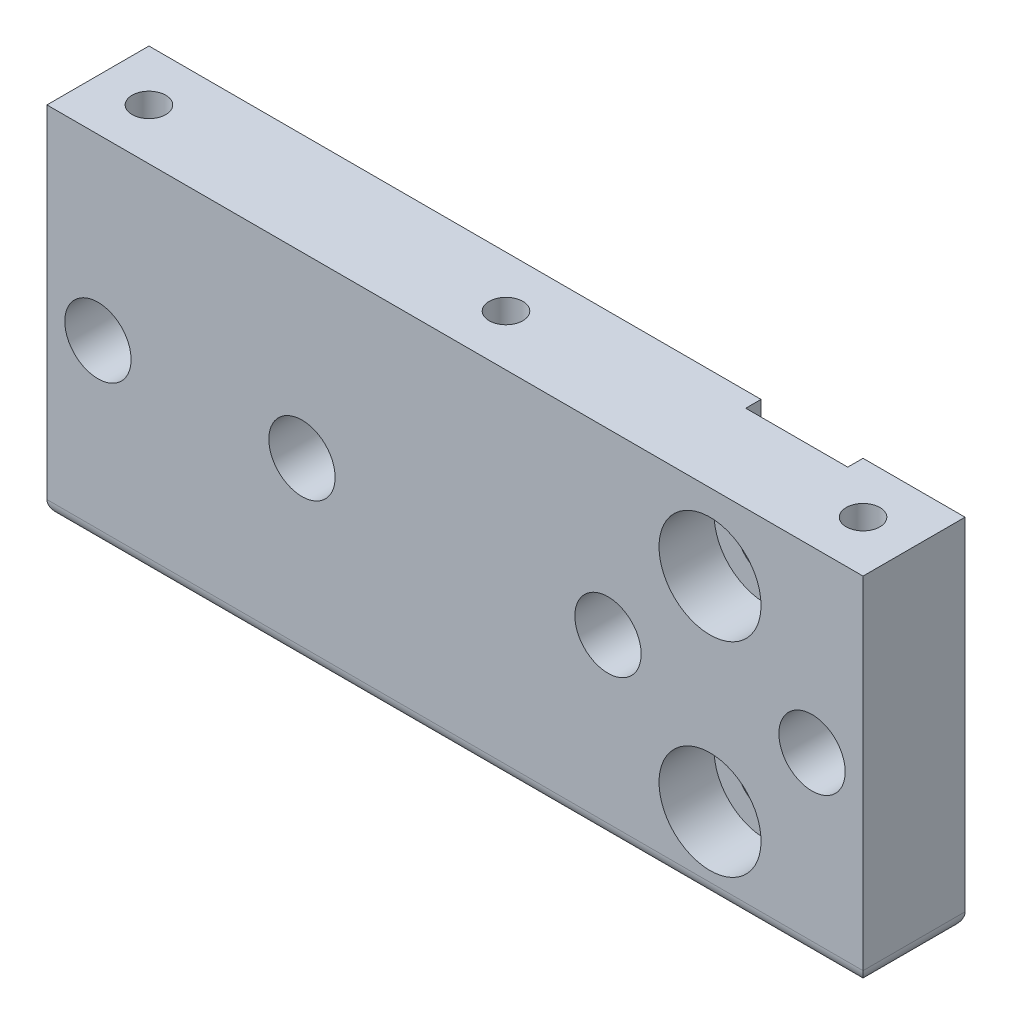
ISO-10303-21;
HEADER;
FILE_DESCRIPTION(('STEP AP214'),'2;1');
FILE_NAME('part.step','',(''),(''),'','','');
FILE_SCHEMA(('AUTOMOTIVE_DESIGN { 1 0 10303 214 1 1 1 1 }'));
ENDSEC;
DATA;
#1=APPLICATION_CONTEXT('core data for automotive mechanical design processes');
#2=APPLICATION_PROTOCOL_DEFINITION('international standard','automotive_design',2000,#1);
#3=PRODUCT_CONTEXT('',#1,'mechanical');
#4=PRODUCT('Part','Part','',(#3));
#5=PRODUCT_RELATED_PRODUCT_CATEGORY('part','',(#4));
#6=PRODUCT_DEFINITION_FORMATION('','',#4);
#7=PRODUCT_DEFINITION_CONTEXT('part definition',#1,'design');
#8=PRODUCT_DEFINITION('design','',#6,#7);
#9=PRODUCT_DEFINITION_SHAPE('','',#8);
#10=(LENGTH_UNIT() NAMED_UNIT(*) SI_UNIT(.MILLI.,.METRE.));
#11=(NAMED_UNIT(*) PLANE_ANGLE_UNIT() SI_UNIT($,.RADIAN.));
#12=(NAMED_UNIT(*) SI_UNIT($,.STERADIAN.) SOLID_ANGLE_UNIT());
#13=UNCERTAINTY_MEASURE_WITH_UNIT(LENGTH_MEASURE(1.E-05),#10,'distance_accuracy_value','');
#14=(GEOMETRIC_REPRESENTATION_CONTEXT(3) GLOBAL_UNCERTAINTY_ASSIGNED_CONTEXT((#13)) GLOBAL_UNIT_ASSIGNED_CONTEXT((#10,
#11,#12)) REPRESENTATION_CONTEXT('',''));
#15=CARTESIAN_POINT('',(0.,0.,0.));
#16=DIRECTION('',(0.,0.,1.));
#17=DIRECTION('',(1.,0.,0.));
#18=AXIS2_PLACEMENT_3D('',#15,#16,#17);
#19=CARTESIAN_POINT('',(35.,5.99999999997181,-5.));
#20=DIRECTION('',(0.,1.,0.));
#21=DIRECTION('',(0.,0.,1.));
#22=AXIS2_PLACEMENT_3D('',#19,#20,#21);
#23=CONICAL_SURFACE('',#22,1.64999999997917,1.02974425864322);
#24=CARTESIAN_POINT('',(35.,5.00857997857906,-5.0000000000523));
#25=VERTEX_POINT('',#24);
#26=VERTEX_LOOP('',#25);
#27=FACE_BOUND('',#26,.T.);
#28=CARTESIAN_POINT('',(35.,6.00000000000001,-5.));
#29=DIRECTION('',(0.,1.,0.));
#30=DIRECTION('',(0.,0.,1.));
#31=AXIS2_PLACEMENT_3D('',#28,#29,#30);
#32=CIRCLE('',#31,1.65);
#33=CARTESIAN_POINT('',(35.,6.00000000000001,-3.35));
#34=VERTEX_POINT('',#33);
#35=EDGE_CURVE('E185',#34,#34,#32,.T.);
#36=ORIENTED_EDGE('',*,*,#35,.T.);
#37=EDGE_LOOP('',(#36));
#38=FACE_BOUND('',#37,.T.);
#39=ADVANCED_FACE('F16',(#27,#38),#23,.F.);
#40=CARTESIAN_POINT('',(-35.,5.99999999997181,-5.00000000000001));
#41=DIRECTION('',(0.,1.,0.));
#42=DIRECTION('',(0.,0.,1.));
#43=AXIS2_PLACEMENT_3D('',#40,#41,#42);
#44=CONICAL_SURFACE('',#43,1.64999999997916,1.02974425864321);
#45=CARTESIAN_POINT('',(-35.,5.00857997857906,-5.0000000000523));
#46=VERTEX_POINT('',#45);
#47=VERTEX_LOOP('',#46);
#48=FACE_BOUND('',#47,.T.);
#49=CARTESIAN_POINT('',(-35.,6.00000000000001,-5.00000000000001));
#50=DIRECTION('',(0.,1.,0.));
#51=DIRECTION('',(0.,0.,1.));
#52=AXIS2_PLACEMENT_3D('',#49,#50,#51);
#53=CIRCLE('',#52,1.65);
#54=CARTESIAN_POINT('',(-35.,6.00000000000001,-3.35000000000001));
#55=VERTEX_POINT('',#54);
#56=EDGE_CURVE('E182',#55,#55,#53,.T.);
#57=ORIENTED_EDGE('',*,*,#56,.T.);
#58=EDGE_LOOP('',(#57));
#59=FACE_BOUND('',#58,.T.);
#60=ADVANCED_FACE('F333',(#48,#59),#44,.F.);
#61=CARTESIAN_POINT('',(0.,5.99999999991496,-5.));
#62=DIRECTION('',(0.,1.,0.));
#63=DIRECTION('',(-1.,0.,0.));
#64=AXIS2_PLACEMENT_3D('',#61,#62,#63);
#65=CONICAL_SURFACE('',#64,1.64999999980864,1.02974425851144);
#66=CARTESIAN_POINT('',(0.,5.0085799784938,-5.));
#67=VERTEX_POINT('',#66);
#68=VERTEX_LOOP('',#67);
#69=FACE_BOUND('',#68,.T.);
#70=CARTESIAN_POINT('',(0.,6.00000000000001,-5.));
#71=DIRECTION('',(0.,1.,0.));
#72=DIRECTION('',(0.,0.,1.));
#73=AXIS2_PLACEMENT_3D('',#70,#71,#72);
#74=CIRCLE('',#73,1.65);
#75=CARTESIAN_POINT('',(0.,6.00000000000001,-3.35));
#76=VERTEX_POINT('',#75);
#77=EDGE_CURVE('E178',#76,#76,#74,.T.);
#78=ORIENTED_EDGE('',*,*,#77,.T.);
#79=EDGE_LOOP('',(#78));
#80=FACE_BOUND('',#79,.T.);
#81=ADVANCED_FACE('F323',(#69,#80),#65,.F.);
#82=CARTESIAN_POINT('',(25.,10.,0.));
#83=DIRECTION('',(0.,0.,1.));
#84=DIRECTION('',(1.,0.,0.));
#85=AXIS2_PLACEMENT_3D('',#82,#83,#84);
#86=CYLINDRICAL_SURFACE('',#85,2.75);
#87=CARTESIAN_POINT('',(25.,10.,-5.4));
#88=DIRECTION('',(0.,0.,1.));
#89=DIRECTION('',(1.,0.,0.));
#90=AXIS2_PLACEMENT_3D('',#87,#88,#89);
#91=CIRCLE('',#90,2.75);
#92=CARTESIAN_POINT('',(27.75,10.,-5.4));
#93=VERTEX_POINT('',#92);
#94=EDGE_CURVE('E248',#93,#93,#91,.T.);
#95=ORIENTED_EDGE('',*,*,#94,.T.);
#96=EDGE_LOOP('',(#95));
#97=FACE_BOUND('',#96,.T.);
#98=CARTESIAN_POINT('',(25.,10.,-8.5));
#99=DIRECTION('',(0.,0.,1.));
#100=DIRECTION('',(1.,0.,0.));
#101=AXIS2_PLACEMENT_3D('',#98,#99,#100);
#102=CIRCLE('',#101,2.75);
#103=CARTESIAN_POINT('',(27.75,10.,-8.5));
#104=VERTEX_POINT('',#103);
#105=EDGE_CURVE('E181',#104,#104,#102,.T.);
#106=ORIENTED_EDGE('',*,*,#105,.F.);
#107=EDGE_LOOP('',(#106));
#108=FACE_BOUND('',#107,.T.);
#109=ADVANCED_FACE('F320',(#97,#108),#86,.F.);
#110=CARTESIAN_POINT('',(25.,-10.,0.));
#111=DIRECTION('',(0.,0.,1.));
#112=DIRECTION('',(1.,0.,0.));
#113=AXIS2_PLACEMENT_3D('',#110,#111,#112);
#114=CYLINDRICAL_SURFACE('',#113,2.75);
#115=CARTESIAN_POINT('',(25.,-10.,-5.4));
#116=DIRECTION('',(0.,0.,1.));
#117=DIRECTION('',(1.,0.,0.));
#118=AXIS2_PLACEMENT_3D('',#115,#116,#117);
#119=CIRCLE('',#118,2.75);
#120=CARTESIAN_POINT('',(27.75,-10.,-5.4));
#121=VERTEX_POINT('',#120);
#122=EDGE_CURVE('E173',#121,#121,#119,.T.);
#123=ORIENTED_EDGE('',*,*,#122,.T.);
#124=EDGE_LOOP('',(#123));
#125=FACE_BOUND('',#124,.T.);
#126=CARTESIAN_POINT('',(25.,-10.,-8.5));
#127=DIRECTION('',(0.,0.,1.));
#128=DIRECTION('',(1.,0.,0.));
#129=AXIS2_PLACEMENT_3D('',#126,#127,#128);
#130=CIRCLE('',#129,2.75);
#131=CARTESIAN_POINT('',(27.75,-10.,-8.5));
#132=VERTEX_POINT('',#131);
#133=EDGE_CURVE('E175',#132,#132,#130,.T.);
#134=ORIENTED_EDGE('',*,*,#133,.F.);
#135=EDGE_LOOP('',(#134));
#136=FACE_BOUND('',#135,.T.);
#137=ADVANCED_FACE('F322',(#125,#136),#114,.F.);
#138=CARTESIAN_POINT('',(20.,17.5,-8.5));
#139=DIRECTION('',(-1.,0.,0.));
#140=DIRECTION('',(0.,-1.,0.));
#141=AXIS2_PLACEMENT_3D('',#138,#139,#140);
#142=PLANE('',#141);
#143=DIRECTION('',(0.,0.,1.));
#144=VECTOR('',#143,1.);
#145=CARTESIAN_POINT('',(20.,17.5,-8.5));
#146=LINE('',#145,#144);
#147=CARTESIAN_POINT('',(20.,17.5,-8.5));
#148=VERTEX_POINT('',#147);
#149=CARTESIAN_POINT('',(20.,17.5,-10.));
#150=VERTEX_POINT('',#149);
#151=EDGE_CURVE('E119',#148,#150,#146,.F.);
#152=ORIENTED_EDGE('',*,*,#151,.F.);
#153=DIRECTION('',(0.,1.,0.));
#154=VECTOR('',#153,1.);
#155=CARTESIAN_POINT('',(20.,-17.5,-8.5));
#156=LINE('',#155,#154);
#157=CARTESIAN_POINT('',(20.,-17.5,-8.5));
#158=VERTEX_POINT('',#157);
#159=EDGE_CURVE('E114',#158,#148,#156,.T.);
#160=ORIENTED_EDGE('',*,*,#159,.F.);
#161=CARTESIAN_POINT('',(20.,-16.,-8.5));
#162=DIRECTION('',(-1.,0.,0.));
#163=DIRECTION('',(0.,-1.,0.));
#164=AXIS2_PLACEMENT_3D('',#161,#162,#163);
#165=CIRCLE('',#164,1.5);
#166=CARTESIAN_POINT('',(20.,-16.,-10.));
#167=VERTEX_POINT('',#166);
#168=EDGE_CURVE('E19',#167,#158,#165,.T.);
#169=ORIENTED_EDGE('',*,*,#168,.F.);
#170=DIRECTION('',(0.,1.,0.));
#171=VECTOR('',#170,1.);
#172=CARTESIAN_POINT('',(20.,-17.5,-10.));
#173=LINE('',#172,#171);
#174=EDGE_CURVE('E99',#150,#167,#173,.F.);
#175=ORIENTED_EDGE('',*,*,#174,.F.);
#176=EDGE_LOOP('',(#152,#160,#169,#175));
#177=FACE_BOUND('',#176,.T.);
#178=ADVANCED_FACE('F112',(#177),#142,.F.);
#179=CARTESIAN_POINT('',(-40.,-16.,-8.5));
#180=DIRECTION('',(-1.,0.,0.));
#181=DIRECTION('',(0.,-1.,0.));
#182=AXIS2_PLACEMENT_3D('',#179,#180,#181);
#183=CYLINDRICAL_SURFACE('',#182,1.5);
#184=ORIENTED_EDGE('',*,*,#168,.T.);
#185=DIRECTION('',(-1.,0.,0.));
#186=VECTOR('',#185,1.);
#187=CARTESIAN_POINT('',(-40.,-17.5,-8.5));
#188=LINE('',#187,#186);
#189=CARTESIAN_POINT('',(-38.5,-17.5,-8.5));
#190=VERTEX_POINT('',#189);
#191=EDGE_CURVE('E149',#158,#190,#188,.T.);
#192=ORIENTED_EDGE('',*,*,#191,.T.);
#193=CARTESIAN_POINT('',(-38.5,-16.,-8.5));
#194=DIRECTION('',(-0.707106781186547,0.,0.707106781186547));
#195=DIRECTION('',(0.707106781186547,0.,0.707106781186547));
#196=AXIS2_PLACEMENT_3D('',#193,#194,#195);
#197=ELLIPSE('',#196,2.12132034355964,1.5);
#198=CARTESIAN_POINT('',(-40.,-16.,-10.));
#199=VERTEX_POINT('',#198);
#200=EDGE_CURVE('E121',#199,#190,#197,.T.);
#201=ORIENTED_EDGE('',*,*,#200,.F.);
#202=DIRECTION('',(-1.,0.,0.));
#203=VECTOR('',#202,1.);
#204=CARTESIAN_POINT('',(-40.,-16.,-10.));
#205=LINE('',#204,#203);
#206=EDGE_CURVE('E103',#167,#199,#205,.T.);
#207=ORIENTED_EDGE('',*,*,#206,.F.);
#208=EDGE_LOOP('',(#184,#192,#201,#207));
#209=FACE_BOUND('',#208,.T.);
#210=ADVANCED_FACE('F120',(#209),#183,.T.);
#211=CARTESIAN_POINT('',(30.,17.5,-8.5));
#212=DIRECTION('',(1.,0.,0.));
#213=DIRECTION('',(0.,1.,0.));
#214=AXIS2_PLACEMENT_3D('',#211,#212,#213);
#215=PLANE('',#214);
#216=DIRECTION('',(0.,0.,1.));
#217=VECTOR('',#216,1.);
#218=CARTESIAN_POINT('',(30.,17.5,-8.5));
#219=LINE('',#218,#217);
#220=CARTESIAN_POINT('',(30.,17.5,-10.));
#221=VERTEX_POINT('',#220);
#222=CARTESIAN_POINT('',(30.,17.5,-8.5));
#223=VERTEX_POINT('',#222);
#224=EDGE_CURVE('E118',#221,#223,#219,.T.);
#225=ORIENTED_EDGE('',*,*,#224,.F.);
#226=DIRECTION('',(0.,1.,0.));
#227=VECTOR('',#226,1.);
#228=CARTESIAN_POINT('',(30.,-17.5,-10.));
#229=LINE('',#228,#227);
#230=CARTESIAN_POINT('',(30.,-16.,-10.));
#231=VERTEX_POINT('',#230);
#232=EDGE_CURVE('E131',#231,#221,#229,.T.);
#233=ORIENTED_EDGE('',*,*,#232,.F.);
#234=CARTESIAN_POINT('',(30.,-16.,-8.5));
#235=DIRECTION('',(-1.,0.,0.));
#236=DIRECTION('',(0.,-1.,0.));
#237=AXIS2_PLACEMENT_3D('',#234,#235,#236);
#238=CIRCLE('',#237,1.5);
#239=CARTESIAN_POINT('',(30.,-17.5,-8.5));
#240=VERTEX_POINT('',#239);
#241=EDGE_CURVE('E138',#240,#231,#238,.F.);
#242=ORIENTED_EDGE('',*,*,#241,.F.);
#243=DIRECTION('',(0.,1.,0.));
#244=VECTOR('',#243,1.);
#245=CARTESIAN_POINT('',(30.,-17.5,-8.5));
#246=LINE('',#245,#244);
#247=EDGE_CURVE('E160',#223,#240,#246,.F.);
#248=ORIENTED_EDGE('',*,*,#247,.F.);
#249=EDGE_LOOP('',(#225,#233,#242,#248));
#250=FACE_BOUND('',#249,.T.);
#251=ADVANCED_FACE('F264',(#250),#215,.F.);
#252=CARTESIAN_POINT('',(-40.,-16.,-8.5));
#253=DIRECTION('',(-1.,0.,0.));
#254=DIRECTION('',(0.,-1.,0.));
#255=AXIS2_PLACEMENT_3D('',#252,#253,#254);
#256=CYLINDRICAL_SURFACE('',#255,1.5);
#257=CARTESIAN_POINT('',(38.5,-16.,-8.5));
#258=DIRECTION('',(0.707106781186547,0.,0.707106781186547));
#259=DIRECTION('',(-0.707106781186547,0.,0.707106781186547));
#260=AXIS2_PLACEMENT_3D('',#257,#258,#259);
#261=ELLIPSE('',#260,2.12132034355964,1.5);
#262=CARTESIAN_POINT('',(38.5,-17.5,-8.5));
#263=VERTEX_POINT('',#262);
#264=CARTESIAN_POINT('',(40.,-16.,-10.));
#265=VERTEX_POINT('',#264);
#266=EDGE_CURVE('E123',#263,#265,#261,.T.);
#267=ORIENTED_EDGE('',*,*,#266,.F.);
#268=DIRECTION('',(-1.,0.,0.));
#269=VECTOR('',#268,1.);
#270=CARTESIAN_POINT('',(-40.,-17.5,-8.5));
#271=LINE('',#270,#269);
#272=EDGE_CURVE('E147',#263,#240,#271,.T.);
#273=ORIENTED_EDGE('',*,*,#272,.T.);
#274=ORIENTED_EDGE('',*,*,#241,.T.);
#275=DIRECTION('',(-1.,0.,0.));
#276=VECTOR('',#275,1.);
#277=CARTESIAN_POINT('',(-40.,-16.,-10.));
#278=LINE('',#277,#276);
#279=EDGE_CURVE('E134',#265,#231,#278,.T.);
#280=ORIENTED_EDGE('',*,*,#279,.F.);
#281=EDGE_LOOP('',(#267,#273,#274,#280));
#282=FACE_BOUND('',#281,.T.);
#283=ADVANCED_FACE('F254',(#282),#256,.T.);
#284=CARTESIAN_POINT('',(27.75,10.,-5.4));
#285=DIRECTION('',(0.,0.,-1.));
#286=DIRECTION('',(-1.,0.,0.));
#287=AXIS2_PLACEMENT_3D('',#284,#285,#286);
#288=PLANE('',#287);
#289=CARTESIAN_POINT('',(25.,10.,-5.4));
#290=DIRECTION('',(0.,0.,1.));
#291=DIRECTION('',(1.,0.,0.));
#292=AXIS2_PLACEMENT_3D('',#289,#290,#291);
#293=CIRCLE('',#292,5.);
#294=CARTESIAN_POINT('',(30.,10.,-5.4));
#295=VERTEX_POINT('',#294);
#296=EDGE_CURVE('E238',#295,#295,#293,.T.);
#297=ORIENTED_EDGE('',*,*,#296,.T.);
#298=EDGE_LOOP('',(#297));
#299=FACE_BOUND('',#298,.T.);
#300=ORIENTED_EDGE('',*,*,#94,.F.);
#301=EDGE_LOOP('',(#300));
#302=FACE_BOUND('',#301,.T.);
#303=ADVANCED_FACE('F399',(#299,#302),#288,.F.);
#304=CARTESIAN_POINT('',(27.75,-10.,-5.4));
#305=DIRECTION('',(0.,0.,-1.));
#306=DIRECTION('',(-1.,0.,0.));
#307=AXIS2_PLACEMENT_3D('',#304,#305,#306);
#308=PLANE('',#307);
#309=CARTESIAN_POINT('',(25.,-10.,-5.4));
#310=DIRECTION('',(0.,0.,1.));
#311=DIRECTION('',(1.,0.,0.));
#312=AXIS2_PLACEMENT_3D('',#309,#310,#311);
#313=CIRCLE('',#312,5.);
#314=CARTESIAN_POINT('',(30.,-10.,-5.4));
#315=VERTEX_POINT('',#314);
#316=EDGE_CURVE('E235',#315,#315,#313,.T.);
#317=ORIENTED_EDGE('',*,*,#316,.T.);
#318=EDGE_LOOP('',(#317));
#319=FACE_BOUND('',#318,.T.);
#320=ORIENTED_EDGE('',*,*,#122,.F.);
#321=EDGE_LOOP('',(#320));
#322=FACE_BOUND('',#321,.T.);
#323=ADVANCED_FACE('F396',(#319,#322),#308,.F.);
#324=CARTESIAN_POINT('',(-40.,-17.5,-10.));
#325=DIRECTION('',(0.,1.,0.));
#326=DIRECTION('',(-1.,0.,0.));
#327=AXIS2_PLACEMENT_3D('',#324,#325,#326);
#328=PLANE('',#327);
#329=ORIENTED_EDGE('',*,*,#272,.F.);
#330=DIRECTION('',(0.,0.,1.));
#331=VECTOR('',#330,1.);
#332=CARTESIAN_POINT('',(38.5,-17.5,-10.));
#333=LINE('',#332,#331);
#334=CARTESIAN_POINT('',(38.5,-17.5,-1.5));
#335=VERTEX_POINT('',#334);
#336=EDGE_CURVE('E125',#335,#263,#333,.F.);
#337=ORIENTED_EDGE('',*,*,#336,.F.);
#338=DIRECTION('',(1.,0.,0.));
#339=VECTOR('',#338,1.);
#340=CARTESIAN_POINT('',(-40.,-17.5,-1.5));
#341=LINE('',#340,#339);
#342=CARTESIAN_POINT('',(-38.5,-17.5,-1.5));
#343=VERTEX_POINT('',#342);
#344=EDGE_CURVE('E220',#343,#335,#341,.T.);
#345=ORIENTED_EDGE('',*,*,#344,.F.);
#346=DIRECTION('',(0.,0.,1.));
#347=VECTOR('',#346,1.);
#348=CARTESIAN_POINT('',(-38.5,-17.5,-10.));
#349=LINE('',#348,#347);
#350=EDGE_CURVE('E188',#190,#343,#349,.T.);
#351=ORIENTED_EDGE('',*,*,#350,.F.);
#352=ORIENTED_EDGE('',*,*,#191,.F.);
#353=DIRECTION('',(-1.,0.,0.));
#354=VECTOR('',#353,1.);
#355=CARTESIAN_POINT('',(20.,-17.5,-8.5));
#356=LINE('',#355,#354);
#357=EDGE_CURVE('E108',#240,#158,#356,.T.);
#358=ORIENTED_EDGE('',*,*,#357,.F.);
#359=EDGE_LOOP('',(#329,#337,#345,#351,#352,#358));
#360=FACE_BOUND('',#359,.T.);
#361=ADVANCED_FACE('F290',(#360),#328,.F.);
#362=CARTESIAN_POINT('',(-38.5,-16.,-10.));
#363=DIRECTION('',(0.,0.,1.));
#364=DIRECTION('',(1.,0.,0.));
#365=AXIS2_PLACEMENT_3D('',#362,#363,#364);
#366=CYLINDRICAL_SURFACE('',#365,1.5);
#367=ORIENTED_EDGE('',*,*,#200,.T.);
#368=ORIENTED_EDGE('',*,*,#350,.T.);
#369=CARTESIAN_POINT('',(-38.5,-16.,-1.5));
#370=DIRECTION('',(0.707106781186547,0.,0.707106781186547));
#371=DIRECTION('',(0.707106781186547,0.,-0.707106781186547));
#372=AXIS2_PLACEMENT_3D('',#369,#370,#371);
#373=ELLIPSE('',#372,2.12132034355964,1.5);
#374=CARTESIAN_POINT('',(-40.,-16.,0.));
#375=VERTEX_POINT('',#374);
#376=EDGE_CURVE('E217',#375,#343,#373,.T.);
#377=ORIENTED_EDGE('',*,*,#376,.F.);
#378=DIRECTION('',(0.,0.,-1.));
#379=VECTOR('',#378,1.);
#380=CARTESIAN_POINT('',(-40.,-16.,-10.));
#381=LINE('',#380,#379);
#382=EDGE_CURVE('E292',#375,#199,#381,.T.);
#383=ORIENTED_EDGE('',*,*,#382,.T.);
#384=EDGE_LOOP('',(#367,#368,#377,#383));
#385=FACE_BOUND('',#384,.T.);
#386=ADVANCED_FACE('F279',(#385),#366,.T.);
#387=CARTESIAN_POINT('',(35.,17.5,-5.));
#388=DIRECTION('',(0.,1.,0.));
#389=DIRECTION('',(0.,0.,1.));
#390=AXIS2_PLACEMENT_3D('',#387,#388,#389);
#391=CYLINDRICAL_SURFACE('',#390,1.65);
#392=CARTESIAN_POINT('',(35.,17.5,-5.));
#393=DIRECTION('',(0.,1.,0.));
#394=DIRECTION('',(0.,0.,1.));
#395=AXIS2_PLACEMENT_3D('',#392,#393,#394);
#396=CIRCLE('',#395,1.65);
#397=CARTESIAN_POINT('',(35.,17.5,-3.35));
#398=VERTEX_POINT('',#397);
#399=EDGE_CURVE('E214',#398,#398,#396,.T.);
#400=ORIENTED_EDGE('',*,*,#399,.T.);
#401=EDGE_LOOP('',(#400));
#402=FACE_BOUND('',#401,.T.);
#403=ORIENTED_EDGE('',*,*,#35,.F.);
#404=EDGE_LOOP('',(#403));
#405=FACE_BOUND('',#404,.T.);
#406=ADVANCED_FACE('F387',(#402,#405),#391,.F.);
#407=CARTESIAN_POINT('',(-35.,17.5,-5.00000000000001));
#408=DIRECTION('',(0.,1.,0.));
#409=DIRECTION('',(0.,0.,1.));
#410=AXIS2_PLACEMENT_3D('',#407,#408,#409);
#411=CYLINDRICAL_SURFACE('',#410,1.65);
#412=CARTESIAN_POINT('',(-35.,17.5,-5.00000000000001));
#413=DIRECTION('',(0.,1.,0.));
#414=DIRECTION('',(0.,0.,1.));
#415=AXIS2_PLACEMENT_3D('',#412,#413,#414);
#416=CIRCLE('',#415,1.65);
#417=CARTESIAN_POINT('',(-35.,17.5,-3.35000000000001));
#418=VERTEX_POINT('',#417);
#419=EDGE_CURVE('E211',#418,#418,#416,.T.);
#420=ORIENTED_EDGE('',*,*,#419,.T.);
#421=EDGE_LOOP('',(#420));
#422=FACE_BOUND('',#421,.T.);
#423=ORIENTED_EDGE('',*,*,#56,.F.);
#424=EDGE_LOOP('',(#423));
#425=FACE_BOUND('',#424,.T.);
#426=ADVANCED_FACE('F383',(#422,#425),#411,.F.);
#427=CARTESIAN_POINT('',(0.,17.5,-5.));
#428=DIRECTION('',(0.,1.,0.));
#429=DIRECTION('',(0.,0.,1.));
#430=AXIS2_PLACEMENT_3D('',#427,#428,#429);
#431=CYLINDRICAL_SURFACE('',#430,1.65);
#432=CARTESIAN_POINT('',(0.,17.5,-5.));
#433=DIRECTION('',(0.,1.,0.));
#434=DIRECTION('',(0.,0.,1.));
#435=AXIS2_PLACEMENT_3D('',#432,#433,#434);
#436=CIRCLE('',#435,1.65);
#437=CARTESIAN_POINT('',(0.,17.5,-3.35));
#438=VERTEX_POINT('',#437);
#439=EDGE_CURVE('E169',#438,#438,#436,.T.);
#440=ORIENTED_EDGE('',*,*,#439,.T.);
#441=EDGE_LOOP('',(#440));
#442=FACE_BOUND('',#441,.T.);
#443=ORIENTED_EDGE('',*,*,#77,.F.);
#444=EDGE_LOOP('',(#443));
#445=FACE_BOUND('',#444,.T.);
#446=ADVANCED_FACE('F314',(#442,#445),#431,.F.);
#447=CARTESIAN_POINT('',(20.,-17.5,-8.5));
#448=DIRECTION('',(0.,0.,-1.));
#449=DIRECTION('',(-1.,0.,0.));
#450=AXIS2_PLACEMENT_3D('',#447,#448,#449);
#451=PLANE('',#450);
#452=ORIENTED_EDGE('',*,*,#247,.T.);
#453=ORIENTED_EDGE('',*,*,#357,.T.);
#454=ORIENTED_EDGE('',*,*,#159,.T.);
#455=DIRECTION('',(1.,0.,0.));
#456=VECTOR('',#455,1.);
#457=CARTESIAN_POINT('',(-40.,17.5,-8.5));
#458=LINE('',#457,#456);
#459=EDGE_CURVE('E144',#148,#223,#458,.T.);
#460=ORIENTED_EDGE('',*,*,#459,.T.);
#461=EDGE_LOOP('',(#452,#453,#454,#460));
#462=FACE_BOUND('',#461,.T.);
#463=ORIENTED_EDGE('',*,*,#133,.T.);
#464=EDGE_LOOP('',(#463));
#465=FACE_BOUND('',#464,.T.);
#466=ORIENTED_EDGE('',*,*,#105,.T.);
#467=EDGE_LOOP('',(#466));
#468=FACE_BOUND('',#467,.T.);
#469=ADVANCED_FACE('F311',(#462,#465,#468),#451,.T.);
#470=CARTESIAN_POINT('',(-40.,-17.5,-10.));
#471=DIRECTION('',(0.,0.,-1.));
#472=DIRECTION('',(-1.,0.,0.));
#473=AXIS2_PLACEMENT_3D('',#470,#471,#472);
#474=PLANE('',#473);
#475=CARTESIAN_POINT('',(15.,0.,-10.));
#476=DIRECTION('',(0.,0.,-1.));
#477=DIRECTION('',(-1.,0.,0.));
#478=AXIS2_PLACEMENT_3D('',#475,#476,#477);
#479=CIRCLE('',#478,3.25);
#480=CARTESIAN_POINT('',(11.75,0.,-10.));
#481=VERTEX_POINT('',#480);
#482=EDGE_CURVE('E229',#481,#481,#479,.F.);
#483=ORIENTED_EDGE('',*,*,#482,.T.);
#484=EDGE_LOOP('',(#483));
#485=FACE_BOUND('',#484,.T.);
#486=CARTESIAN_POINT('',(-15.,0.,-10.));
#487=DIRECTION('',(0.,0.,-1.));
#488=DIRECTION('',(-1.,0.,0.));
#489=AXIS2_PLACEMENT_3D('',#486,#487,#488);
#490=CIRCLE('',#489,3.25);
#491=CARTESIAN_POINT('',(-18.25,0.,-10.));
#492=VERTEX_POINT('',#491);
#493=EDGE_CURVE('E226',#492,#492,#490,.F.);
#494=ORIENTED_EDGE('',*,*,#493,.T.);
#495=EDGE_LOOP('',(#494));
#496=FACE_BOUND('',#495,.T.);
#497=CARTESIAN_POINT('',(-35.,0.,-10.));
#498=DIRECTION('',(0.,0.,-1.));
#499=DIRECTION('',(-1.,0.,0.));
#500=AXIS2_PLACEMENT_3D('',#497,#498,#499);
#501=CIRCLE('',#500,3.25);
#502=CARTESIAN_POINT('',(-38.25,0.,-10.));
#503=VERTEX_POINT('',#502);
#504=EDGE_CURVE('E223',#503,#503,#501,.F.);
#505=ORIENTED_EDGE('',*,*,#504,.T.);
#506=EDGE_LOOP('',(#505));
#507=FACE_BOUND('',#506,.T.);
#508=ORIENTED_EDGE('',*,*,#174,.T.);
#509=ORIENTED_EDGE('',*,*,#206,.T.);
#510=DIRECTION('',(0.,1.,0.));
#511=VECTOR('',#510,1.);
#512=CARTESIAN_POINT('',(-40.,17.5,-10.));
#513=LINE('',#512,#511);
#514=CARTESIAN_POINT('',(-40.,17.5,-10.));
#515=VERTEX_POINT('',#514);
#516=EDGE_CURVE('E129',#199,#515,#513,.T.);
#517=ORIENTED_EDGE('',*,*,#516,.T.);
#518=DIRECTION('',(1.,0.,0.));
#519=VECTOR('',#518,1.);
#520=CARTESIAN_POINT('',(-40.,17.5,-10.));
#521=LINE('',#520,#519);
#522=EDGE_CURVE('E106',#515,#150,#521,.T.);
#523=ORIENTED_EDGE('',*,*,#522,.T.);
#524=EDGE_LOOP('',(#508,#509,#517,#523));
#525=FACE_BOUND('',#524,.T.);
#526=ADVANCED_FACE('F101',(#485,#496,#507,#525),#474,.T.);
#527=CARTESIAN_POINT('',(38.5,-16.,-10.));
#528=DIRECTION('',(0.,0.,1.));
#529=DIRECTION('',(1.,0.,0.));
#530=AXIS2_PLACEMENT_3D('',#527,#528,#529);
#531=CYLINDRICAL_SURFACE('',#530,1.5);
#532=CARTESIAN_POINT('',(38.5,-16.,-1.5));
#533=DIRECTION('',(0.707106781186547,0.,-0.707106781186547));
#534=DIRECTION('',(0.707106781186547,0.,0.707106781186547));
#535=AXIS2_PLACEMENT_3D('',#532,#533,#534);
#536=ELLIPSE('',#535,2.12132034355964,1.5);
#537=CARTESIAN_POINT('',(40.,-16.,0.));
#538=VERTEX_POINT('',#537);
#539=EDGE_CURVE('E221',#335,#538,#536,.F.);
#540=ORIENTED_EDGE('',*,*,#539,.F.);
#541=ORIENTED_EDGE('',*,*,#336,.T.);
#542=ORIENTED_EDGE('',*,*,#266,.T.);
#543=DIRECTION('',(0.,0.,1.));
#544=VECTOR('',#543,1.);
#545=CARTESIAN_POINT('',(40.,-16.,-10.));
#546=LINE('',#545,#544);
#547=EDGE_CURVE('E157',#265,#538,#546,.T.);
#548=ORIENTED_EDGE('',*,*,#547,.T.);
#549=EDGE_LOOP('',(#540,#541,#542,#548));
#550=FACE_BOUND('',#549,.T.);
#551=ADVANCED_FACE('F302',(#550),#531,.T.);
#552=CARTESIAN_POINT('',(-40.,-17.5,-10.));
#553=DIRECTION('',(0.,0.,-1.));
#554=DIRECTION('',(-1.,0.,0.));
#555=AXIS2_PLACEMENT_3D('',#552,#553,#554);
#556=PLANE('',#555);
#557=CARTESIAN_POINT('',(35.,0.,-10.));
#558=DIRECTION('',(0.,0.,-1.));
#559=DIRECTION('',(-1.,0.,0.));
#560=AXIS2_PLACEMENT_3D('',#557,#558,#559);
#561=CIRCLE('',#560,3.25);
#562=CARTESIAN_POINT('',(31.75,0.,-10.));
#563=VERTEX_POINT('',#562);
#564=EDGE_CURVE('E232',#563,#563,#561,.F.);
#565=ORIENTED_EDGE('',*,*,#564,.T.);
#566=EDGE_LOOP('',(#565));
#567=FACE_BOUND('',#566,.T.);
#568=DIRECTION('',(0.,-1.,0.));
#569=VECTOR('',#568,1.);
#570=CARTESIAN_POINT('',(40.,17.5,-10.));
#571=LINE('',#570,#569);
#572=CARTESIAN_POINT('',(40.,17.5,-10.));
#573=VERTEX_POINT('',#572);
#574=EDGE_CURVE('E208',#573,#265,#571,.T.);
#575=ORIENTED_EDGE('',*,*,#574,.T.);
#576=ORIENTED_EDGE('',*,*,#279,.T.);
#577=ORIENTED_EDGE('',*,*,#232,.T.);
#578=DIRECTION('',(1.,0.,0.));
#579=VECTOR('',#578,1.);
#580=CARTESIAN_POINT('',(-40.,17.5,-10.));
#581=LINE('',#580,#579);
#582=EDGE_CURVE('E141',#221,#573,#581,.T.);
#583=ORIENTED_EDGE('',*,*,#582,.T.);
#584=EDGE_LOOP('',(#575,#576,#577,#583));
#585=FACE_BOUND('',#584,.T.);
#586=ADVANCED_FACE('F261',(#567,#585),#556,.T.);
#587=CARTESIAN_POINT('',(25.,10.,0.));
#588=DIRECTION('',(0.,0.,1.));
#589=DIRECTION('',(1.,0.,0.));
#590=AXIS2_PLACEMENT_3D('',#587,#588,#589);
#591=CYLINDRICAL_SURFACE('',#590,5.);
#592=CARTESIAN_POINT('',(25.,10.,0.));
#593=DIRECTION('',(0.,0.,1.));
#594=DIRECTION('',(1.,0.,0.));
#595=AXIS2_PLACEMENT_3D('',#592,#593,#594);
#596=CIRCLE('',#595,5.);
#597=CARTESIAN_POINT('',(30.,10.,0.));
#598=VERTEX_POINT('',#597);
#599=EDGE_CURVE('E205',#598,#598,#596,.T.);
#600=ORIENTED_EDGE('',*,*,#599,.T.);
#601=EDGE_LOOP('',(#600));
#602=FACE_BOUND('',#601,.T.);
#603=ORIENTED_EDGE('',*,*,#296,.F.);
#604=EDGE_LOOP('',(#603));
#605=FACE_BOUND('',#604,.T.);
#606=ADVANCED_FACE('F368',(#602,#605),#591,.F.);
#607=CARTESIAN_POINT('',(25.,-10.,0.));
#608=DIRECTION('',(0.,0.,1.));
#609=DIRECTION('',(1.,0.,0.));
#610=AXIS2_PLACEMENT_3D('',#607,#608,#609);
#611=CYLINDRICAL_SURFACE('',#610,5.);
#612=CARTESIAN_POINT('',(25.,-10.,0.));
#613=DIRECTION('',(0.,0.,1.));
#614=DIRECTION('',(1.,0.,0.));
#615=AXIS2_PLACEMENT_3D('',#612,#613,#614);
#616=CIRCLE('',#615,5.);
#617=CARTESIAN_POINT('',(30.,-10.,0.));
#618=VERTEX_POINT('',#617);
#619=EDGE_CURVE('E202',#618,#618,#616,.T.);
#620=ORIENTED_EDGE('',*,*,#619,.T.);
#621=EDGE_LOOP('',(#620));
#622=FACE_BOUND('',#621,.T.);
#623=ORIENTED_EDGE('',*,*,#316,.F.);
#624=EDGE_LOOP('',(#623));
#625=FACE_BOUND('',#624,.T.);
#626=ADVANCED_FACE('F364',(#622,#625),#611,.F.);
#627=CARTESIAN_POINT('',(35.,0.,0.));
#628=DIRECTION('',(0.,0.,-1.));
#629=DIRECTION('',(-1.,0.,0.));
#630=AXIS2_PLACEMENT_3D('',#627,#628,#629);
#631=CYLINDRICAL_SURFACE('',#630,3.25);
#632=ORIENTED_EDGE('',*,*,#564,.F.);
#633=EDGE_LOOP('',(#632));
#634=FACE_BOUND('',#633,.T.);
#635=CARTESIAN_POINT('',(35.,0.,0.));
#636=DIRECTION('',(0.,0.,-1.));
#637=DIRECTION('',(-1.,0.,0.));
#638=AXIS2_PLACEMENT_3D('',#635,#636,#637);
#639=CIRCLE('',#638,3.25);
#640=CARTESIAN_POINT('',(31.75,0.,0.));
#641=VERTEX_POINT('',#640);
#642=EDGE_CURVE('E199',#641,#641,#639,.F.);
#643=ORIENTED_EDGE('',*,*,#642,.T.);
#644=EDGE_LOOP('',(#643));
#645=FACE_BOUND('',#644,.T.);
#646=ADVANCED_FACE('F360',(#634,#645),#631,.F.);
#647=CARTESIAN_POINT('',(15.,0.,0.));
#648=DIRECTION('',(0.,0.,-1.));
#649=DIRECTION('',(-1.,0.,0.));
#650=AXIS2_PLACEMENT_3D('',#647,#648,#649);
#651=CYLINDRICAL_SURFACE('',#650,3.25);
#652=ORIENTED_EDGE('',*,*,#482,.F.);
#653=EDGE_LOOP('',(#652));
#654=FACE_BOUND('',#653,.T.);
#655=CARTESIAN_POINT('',(15.,0.,0.));
#656=DIRECTION('',(0.,0.,-1.));
#657=DIRECTION('',(-1.,0.,0.));
#658=AXIS2_PLACEMENT_3D('',#655,#656,#657);
#659=CIRCLE('',#658,3.25);
#660=CARTESIAN_POINT('',(11.75,0.,0.));
#661=VERTEX_POINT('',#660);
#662=EDGE_CURVE('E196',#661,#661,#659,.F.);
#663=ORIENTED_EDGE('',*,*,#662,.T.);
#664=EDGE_LOOP('',(#663));
#665=FACE_BOUND('',#664,.T.);
#666=ADVANCED_FACE('F356',(#654,#665),#651,.F.);
#667=CARTESIAN_POINT('',(-15.,0.,0.));
#668=DIRECTION('',(0.,0.,-1.));
#669=DIRECTION('',(-1.,0.,0.));
#670=AXIS2_PLACEMENT_3D('',#667,#668,#669);
#671=CYLINDRICAL_SURFACE('',#670,3.25);
#672=ORIENTED_EDGE('',*,*,#493,.F.);
#673=EDGE_LOOP('',(#672));
#674=FACE_BOUND('',#673,.T.);
#675=CARTESIAN_POINT('',(-15.,0.,0.));
#676=DIRECTION('',(0.,0.,-1.));
#677=DIRECTION('',(-1.,0.,0.));
#678=AXIS2_PLACEMENT_3D('',#675,#676,#677);
#679=CIRCLE('',#678,3.25);
#680=CARTESIAN_POINT('',(-18.25,0.,0.));
#681=VERTEX_POINT('',#680);
#682=EDGE_CURVE('E193',#681,#681,#679,.F.);
#683=ORIENTED_EDGE('',*,*,#682,.T.);
#684=EDGE_LOOP('',(#683));
#685=FACE_BOUND('',#684,.T.);
#686=ADVANCED_FACE('F352',(#674,#685),#671,.F.);
#687=CARTESIAN_POINT('',(-35.,0.,0.));
#688=DIRECTION('',(0.,0.,-1.));
#689=DIRECTION('',(-1.,0.,0.));
#690=AXIS2_PLACEMENT_3D('',#687,#688,#689);
#691=CYLINDRICAL_SURFACE('',#690,3.25);
#692=ORIENTED_EDGE('',*,*,#504,.F.);
#693=EDGE_LOOP('',(#692));
#694=FACE_BOUND('',#693,.T.);
#695=CARTESIAN_POINT('',(-35.,0.,0.));
#696=DIRECTION('',(0.,0.,-1.));
#697=DIRECTION('',(-1.,0.,0.));
#698=AXIS2_PLACEMENT_3D('',#695,#696,#697);
#699=CIRCLE('',#698,3.25);
#700=CARTESIAN_POINT('',(-38.25,0.,0.));
#701=VERTEX_POINT('',#700);
#702=EDGE_CURVE('E189',#701,#701,#699,.F.);
#703=ORIENTED_EDGE('',*,*,#702,.T.);
#704=EDGE_LOOP('',(#703));
#705=FACE_BOUND('',#704,.T.);
#706=ADVANCED_FACE('F349',(#694,#705),#691,.F.);
#707=CARTESIAN_POINT('',(-40.,-16.,-1.5));
#708=DIRECTION('',(1.,0.,0.));
#709=DIRECTION('',(0.,1.,0.));
#710=AXIS2_PLACEMENT_3D('',#707,#708,#709);
#711=CYLINDRICAL_SURFACE('',#710,1.5);
#712=ORIENTED_EDGE('',*,*,#376,.T.);
#713=ORIENTED_EDGE('',*,*,#344,.T.);
#714=ORIENTED_EDGE('',*,*,#539,.T.);
#715=DIRECTION('',(-1.,0.,0.));
#716=VECTOR('',#715,1.);
#717=CARTESIAN_POINT('',(-40.,-16.,0.));
#718=LINE('',#717,#716);
#719=EDGE_CURVE('E192',#538,#375,#718,.T.);
#720=ORIENTED_EDGE('',*,*,#719,.T.);
#721=EDGE_LOOP('',(#712,#713,#714,#720));
#722=FACE_BOUND('',#721,.T.);
#723=ADVANCED_FACE('F287',(#722),#711,.T.);
#724=CARTESIAN_POINT('',(-40.,17.5,-10.));
#725=DIRECTION('',(1.,0.,0.));
#726=DIRECTION('',(0.,0.,-1.));
#727=AXIS2_PLACEMENT_3D('',#724,#725,#726);
#728=PLANE('',#727);
#729=DIRECTION('',(0.,0.,1.));
#730=VECTOR('',#729,1.);
#731=CARTESIAN_POINT('',(-40.,17.5,-10.));
#732=LINE('',#731,#730);
#733=CARTESIAN_POINT('',(-40.,17.5,0.));
#734=VERTEX_POINT('',#733);
#735=EDGE_CURVE('E143',#734,#515,#732,.F.);
#736=ORIENTED_EDGE('',*,*,#735,.T.);
#737=ORIENTED_EDGE('',*,*,#516,.F.);
#738=ORIENTED_EDGE('',*,*,#382,.F.);
#739=DIRECTION('',(0.,1.,0.));
#740=VECTOR('',#739,1.);
#741=CARTESIAN_POINT('',(-40.,-17.5,0.));
#742=LINE('',#741,#740);
#743=EDGE_CURVE('E298',#375,#734,#742,.T.);
#744=ORIENTED_EDGE('',*,*,#743,.T.);
#745=EDGE_LOOP('',(#736,#737,#738,#744));
#746=FACE_BOUND('',#745,.T.);
#747=ADVANCED_FACE('F309',(#746),#728,.F.);
#748=CARTESIAN_POINT('',(-40.,17.5,-10.));
#749=DIRECTION('',(0.,-1.,0.));
#750=DIRECTION('',(1.,0.,0.));
#751=AXIS2_PLACEMENT_3D('',#748,#749,#750);
#752=PLANE('',#751);
#753=ORIENTED_EDGE('',*,*,#735,.F.);
#754=DIRECTION('',(-1.,0.,0.));
#755=VECTOR('',#754,1.);
#756=CARTESIAN_POINT('',(-40.,17.5,0.));
#757=LINE('',#756,#755);
#758=CARTESIAN_POINT('',(40.,17.5,0.));
#759=VERTEX_POINT('',#758);
#760=EDGE_CURVE('E25',#734,#759,#757,.F.);
#761=ORIENTED_EDGE('',*,*,#760,.T.);
#762=DIRECTION('',(0.,0.,1.));
#763=VECTOR('',#762,1.);
#764=CARTESIAN_POINT('',(40.,17.5,-10.));
#765=LINE('',#764,#763);
#766=EDGE_CURVE('E33',#759,#573,#765,.F.);
#767=ORIENTED_EDGE('',*,*,#766,.T.);
#768=ORIENTED_EDGE('',*,*,#582,.F.);
#769=ORIENTED_EDGE('',*,*,#224,.T.);
#770=ORIENTED_EDGE('',*,*,#459,.F.);
#771=ORIENTED_EDGE('',*,*,#151,.T.);
#772=ORIENTED_EDGE('',*,*,#522,.F.);
#773=EDGE_LOOP('',(#753,#761,#767,#768,#769,#770,#771,#772));
#774=FACE_BOUND('',#773,.T.);
#775=ORIENTED_EDGE('',*,*,#439,.F.);
#776=EDGE_LOOP('',(#775));
#777=FACE_BOUND('',#776,.T.);
#778=ORIENTED_EDGE('',*,*,#419,.F.);
#779=EDGE_LOOP('',(#778));
#780=FACE_BOUND('',#779,.T.);
#781=ORIENTED_EDGE('',*,*,#399,.F.);
#782=EDGE_LOOP('',(#781));
#783=FACE_BOUND('',#782,.T.);
#784=ADVANCED_FACE('F267',(#774,#777,#780,#783),#752,.F.);
#785=CARTESIAN_POINT('',(40.,17.5,-10.));
#786=DIRECTION('',(-1.,0.,0.));
#787=DIRECTION('',(0.,-1.,0.));
#788=AXIS2_PLACEMENT_3D('',#785,#786,#787);
#789=PLANE('',#788);
#790=ORIENTED_EDGE('',*,*,#766,.F.);
#791=DIRECTION('',(0.,1.,0.));
#792=VECTOR('',#791,1.);
#793=CARTESIAN_POINT('',(40.,-17.5,0.));
#794=LINE('',#793,#792);
#795=EDGE_CURVE('E11',#759,#538,#794,.F.);
#796=ORIENTED_EDGE('',*,*,#795,.T.);
#797=ORIENTED_EDGE('',*,*,#547,.F.);
#798=ORIENTED_EDGE('',*,*,#574,.F.);
#799=EDGE_LOOP('',(#790,#796,#797,#798));
#800=FACE_BOUND('',#799,.T.);
#801=ADVANCED_FACE('F271',(#800),#789,.F.);
#802=CARTESIAN_POINT('',(-40.,-17.5,0.));
#803=DIRECTION('',(0.,0.,-1.));
#804=DIRECTION('',(-1.,0.,0.));
#805=AXIS2_PLACEMENT_3D('',#802,#803,#804);
#806=PLANE('',#805);
#807=ORIENTED_EDGE('',*,*,#760,.F.);
#808=ORIENTED_EDGE('',*,*,#743,.F.);
#809=ORIENTED_EDGE('',*,*,#719,.F.);
#810=ORIENTED_EDGE('',*,*,#795,.F.);
#811=EDGE_LOOP('',(#807,#808,#809,#810));
#812=FACE_BOUND('',#811,.T.);
#813=ORIENTED_EDGE('',*,*,#702,.F.);
#814=EDGE_LOOP('',(#813));
#815=FACE_BOUND('',#814,.T.);
#816=ORIENTED_EDGE('',*,*,#682,.F.);
#817=EDGE_LOOP('',(#816));
#818=FACE_BOUND('',#817,.T.);
#819=ORIENTED_EDGE('',*,*,#662,.F.);
#820=EDGE_LOOP('',(#819));
#821=FACE_BOUND('',#820,.T.);
#822=ORIENTED_EDGE('',*,*,#642,.F.);
#823=EDGE_LOOP('',(#822));
#824=FACE_BOUND('',#823,.T.);
#825=ORIENTED_EDGE('',*,*,#619,.F.);
#826=EDGE_LOOP('',(#825));
#827=FACE_BOUND('',#826,.T.);
#828=ORIENTED_EDGE('',*,*,#599,.F.);
#829=EDGE_LOOP('',(#828));
#830=FACE_BOUND('',#829,.T.);
#831=ADVANCED_FACE('F305',(#812,#815,#818,#821,#824,#827,#830),#806,.F.);
#832=CLOSED_SHELL('',(#39,#60,#81,#109,#137,#178,#210,#251,#283,#303,#323,#361,#386,#406,#426,
#446,#469,#526,#551,#586,#606,#626,#646,#666,#686,#706,#723,#747,#784,#801,#831));
#833=MANIFOLD_SOLID_BREP('B1',#832);
#834=ADVANCED_BREP_SHAPE_REPRESENTATION('',(#18,#833),#14);
#835=SHAPE_DEFINITION_REPRESENTATION(#9,#834);
ENDSEC;
END-ISO-10303-21;
